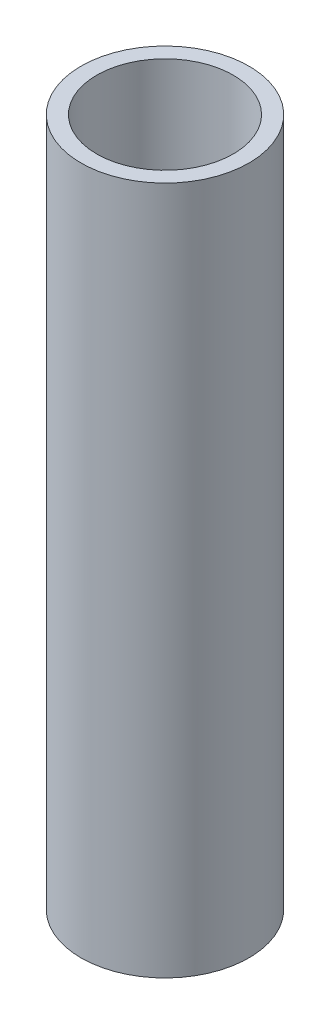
from build123d import *

# Parameters (mm, degrees)
SKETCH1_R           = 4.7625
SKETCH1_R_2         = 3.8735
BOSS_EXTRUDE1_DEPTH = 39.042242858


with BuildPart() as part:
    # Sketch1 → Boss-Extrude1 (new body)
    with BuildSketch(Plane(origin=(0, 0, 0), x_dir=(1, 0, 0), z_dir=(0, 1, 0))):
        with Locations(Location((0, 0, 0), (0, 0, 227.419521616))):
            Circle(SKETCH1_R)
        with Locations(Location((0, 0, 0), (0, 0, 270))):
            Circle(SKETCH1_R_2, mode=Mode.SUBTRACT)
    extrude(amount=BOSS_EXTRUDE1_DEPTH)


solid = part.part
